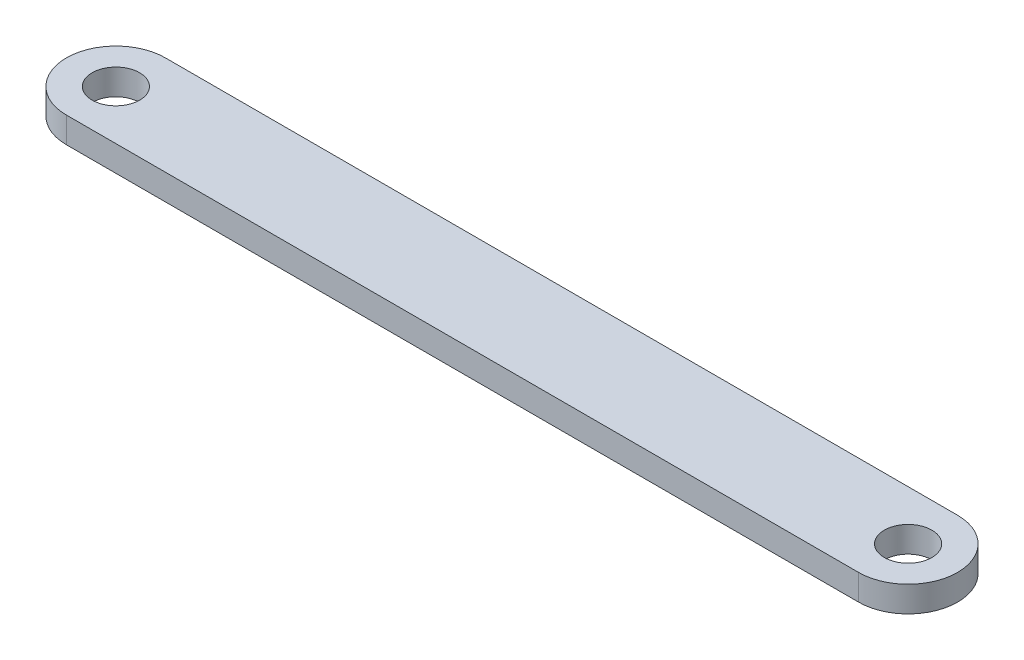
ISO-10303-21;
HEADER;
FILE_DESCRIPTION(('STEP AP214'),'2;1');
FILE_NAME('part.step','',(''),(''),'','','');
FILE_SCHEMA(('AUTOMOTIVE_DESIGN { 1 0 10303 214 1 1 1 1 }'));
ENDSEC;
DATA;
#1=APPLICATION_CONTEXT('core data for automotive mechanical design processes');
#2=APPLICATION_PROTOCOL_DEFINITION('international standard','automotive_design',2000,#1);
#3=PRODUCT_CONTEXT('',#1,'mechanical');
#4=PRODUCT('Part','Part','',(#3));
#5=PRODUCT_RELATED_PRODUCT_CATEGORY('part','',(#4));
#6=PRODUCT_DEFINITION_FORMATION('','',#4);
#7=PRODUCT_DEFINITION_CONTEXT('part definition',#1,'design');
#8=PRODUCT_DEFINITION('design','',#6,#7);
#9=PRODUCT_DEFINITION_SHAPE('','',#8);
#10=(LENGTH_UNIT() NAMED_UNIT(*) SI_UNIT(.MILLI.,.METRE.));
#11=(NAMED_UNIT(*) PLANE_ANGLE_UNIT() SI_UNIT($,.RADIAN.));
#12=(NAMED_UNIT(*) SI_UNIT($,.STERADIAN.) SOLID_ANGLE_UNIT());
#13=UNCERTAINTY_MEASURE_WITH_UNIT(LENGTH_MEASURE(1.E-05),#10,'distance_accuracy_value','');
#14=(GEOMETRIC_REPRESENTATION_CONTEXT(3) GLOBAL_UNCERTAINTY_ASSIGNED_CONTEXT((#13)) GLOBAL_UNIT_ASSIGNED_CONTEXT((#10,
#11,#12)) REPRESENTATION_CONTEXT('',''));
#15=CARTESIAN_POINT('',(0.,0.,0.));
#16=DIRECTION('',(0.,0.,1.));
#17=DIRECTION('',(1.,0.,0.));
#18=AXIS2_PLACEMENT_3D('',#15,#16,#17);
#19=CARTESIAN_POINT('',(0.,6.5,0.));
#20=DIRECTION('',(0.,1.,0.));
#21=DIRECTION('',(0.,0.,1.));
#22=AXIS2_PLACEMENT_3D('',#19,#20,#21);
#23=PLANE('',#22);
#24=CARTESIAN_POINT('',(0.,6.5,0.));
#25=DIRECTION('',(0.,1.,0.));
#26=DIRECTION('',(0.,0.,1.));
#27=AXIS2_PLACEMENT_3D('',#24,#25,#26);
#28=CIRCLE('',#27,6.);
#29=CARTESIAN_POINT('',(0.,6.5,-6.));
#30=VERTEX_POINT('',#29);
#31=EDGE_CURVE('E116',#30,#30,#28,.T.);
#32=ORIENTED_EDGE('',*,*,#31,.F.);
#33=EDGE_LOOP('',(#32));
#34=FACE_BOUND('',#33,.T.);
#35=CARTESIAN_POINT('',(0.,6.5,0.));
#36=DIRECTION('',(0.,1.,0.));
#37=DIRECTION('',(0.,0.,1.));
#38=AXIS2_PLACEMENT_3D('',#35,#36,#37);
#39=CIRCLE('',#38,12.5);
#40=CARTESIAN_POINT('',(0.,6.5,-12.5));
#41=VERTEX_POINT('',#40);
#42=CARTESIAN_POINT('',(0.,6.5,12.5));
#43=VERTEX_POINT('',#42);
#44=EDGE_CURVE('E96',#41,#43,#39,.T.);
#45=ORIENTED_EDGE('',*,*,#44,.T.);
#46=DIRECTION('',(1.,0.,0.));
#47=VECTOR('',#46,1.);
#48=CARTESIAN_POINT('',(0.,6.5,12.5));
#49=LINE('',#48,#47);
#50=CARTESIAN_POINT('',(200.,6.5,12.5));
#51=VERTEX_POINT('',#50);
#52=EDGE_CURVE('E91',#43,#51,#49,.T.);
#53=ORIENTED_EDGE('',*,*,#52,.T.);
#54=CARTESIAN_POINT('',(200.,6.5,0.));
#55=DIRECTION('',(0.,1.,0.));
#56=DIRECTION('',(0.,0.,1.));
#57=AXIS2_PLACEMENT_3D('',#54,#55,#56);
#58=CIRCLE('',#57,12.5);
#59=CARTESIAN_POINT('',(200.,6.5,-12.5));
#60=VERTEX_POINT('',#59);
#61=EDGE_CURVE('E94',#51,#60,#58,.T.);
#62=ORIENTED_EDGE('',*,*,#61,.T.);
#63=DIRECTION('',(-1.,0.,0.));
#64=VECTOR('',#63,1.);
#65=CARTESIAN_POINT('',(0.,6.5,-12.5));
#66=LINE('',#65,#64);
#67=EDGE_CURVE('E61',#60,#41,#66,.T.);
#68=ORIENTED_EDGE('',*,*,#67,.T.);
#69=EDGE_LOOP('',(#45,#53,#62,#68));
#70=FACE_BOUND('',#69,.T.);
#71=CARTESIAN_POINT('',(200.,6.5,0.));
#72=DIRECTION('',(0.,1.,0.));
#73=DIRECTION('',(0.,0.,1.));
#74=AXIS2_PLACEMENT_3D('',#71,#72,#73);
#75=CIRCLE('',#74,6.00000000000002);
#76=CARTESIAN_POINT('',(200.,6.5,-6.00000000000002));
#77=VERTEX_POINT('',#76);
#78=EDGE_CURVE('E138',#77,#77,#75,.T.);
#79=ORIENTED_EDGE('',*,*,#78,.F.);
#80=EDGE_LOOP('',(#79));
#81=FACE_BOUND('',#80,.T.);
#82=ADVANCED_FACE('F43',(#34,#70,#81),#23,.T.);
#83=CARTESIAN_POINT('',(0.,0.,0.));
#84=DIRECTION('',(0.,1.,0.));
#85=DIRECTION('',(0.,0.,1.));
#86=AXIS2_PLACEMENT_3D('',#83,#84,#85);
#87=PLANE('',#86);
#88=CARTESIAN_POINT('',(0.,0.,0.));
#89=DIRECTION('',(0.,1.,0.));
#90=DIRECTION('',(0.,0.,1.));
#91=AXIS2_PLACEMENT_3D('',#88,#89,#90);
#92=CIRCLE('',#91,12.5);
#93=CARTESIAN_POINT('',(0.,0.,-12.5));
#94=VERTEX_POINT('',#93);
#95=CARTESIAN_POINT('',(0.,0.,12.5));
#96=VERTEX_POINT('',#95);
#97=EDGE_CURVE('E112',#94,#96,#92,.T.);
#98=ORIENTED_EDGE('',*,*,#97,.F.);
#99=DIRECTION('',(-1.,0.,0.));
#100=VECTOR('',#99,1.);
#101=CARTESIAN_POINT('',(0.,0.,-12.5));
#102=LINE('',#101,#100);
#103=CARTESIAN_POINT('',(200.,0.,-12.5));
#104=VERTEX_POINT('',#103);
#105=EDGE_CURVE('E84',#104,#94,#102,.T.);
#106=ORIENTED_EDGE('',*,*,#105,.F.);
#107=CARTESIAN_POINT('',(200.,0.,0.));
#108=DIRECTION('',(0.,1.,0.));
#109=DIRECTION('',(0.,0.,1.));
#110=AXIS2_PLACEMENT_3D('',#107,#108,#109);
#111=CIRCLE('',#110,12.5);
#112=CARTESIAN_POINT('',(200.,0.,12.5));
#113=VERTEX_POINT('',#112);
#114=EDGE_CURVE('E78',#113,#104,#111,.T.);
#115=ORIENTED_EDGE('',*,*,#114,.F.);
#116=DIRECTION('',(1.,0.,0.));
#117=VECTOR('',#116,1.);
#118=CARTESIAN_POINT('',(0.,0.,12.5));
#119=LINE('',#118,#117);
#120=EDGE_CURVE('E101',#96,#113,#119,.T.);
#121=ORIENTED_EDGE('',*,*,#120,.F.);
#122=EDGE_LOOP('',(#98,#106,#115,#121));
#123=FACE_BOUND('',#122,.T.);
#124=CARTESIAN_POINT('',(0.,0.,0.));
#125=DIRECTION('',(0.,1.,0.));
#126=DIRECTION('',(0.,0.,1.));
#127=AXIS2_PLACEMENT_3D('',#124,#125,#126);
#128=CIRCLE('',#127,6.);
#129=CARTESIAN_POINT('',(0.,0.,-6.));
#130=VERTEX_POINT('',#129);
#131=EDGE_CURVE('E134',#130,#130,#128,.T.);
#132=ORIENTED_EDGE('',*,*,#131,.T.);
#133=EDGE_LOOP('',(#132));
#134=FACE_BOUND('',#133,.T.);
#135=CARTESIAN_POINT('',(200.,0.,0.));
#136=DIRECTION('',(0.,1.,0.));
#137=DIRECTION('',(0.,0.,1.));
#138=AXIS2_PLACEMENT_3D('',#135,#136,#137);
#139=CIRCLE('',#138,6.00000000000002);
#140=CARTESIAN_POINT('',(200.,0.,-6.00000000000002));
#141=VERTEX_POINT('',#140);
#142=EDGE_CURVE('E142',#141,#141,#139,.T.);
#143=ORIENTED_EDGE('',*,*,#142,.T.);
#144=EDGE_LOOP('',(#143));
#145=FACE_BOUND('',#144,.T.);
#146=ADVANCED_FACE('F129',(#123,#134,#145),#87,.F.);
#147=CARTESIAN_POINT('',(0.,6.5,0.));
#148=DIRECTION('',(0.,-1.,0.));
#149=DIRECTION('',(0.,0.,-1.));
#150=AXIS2_PLACEMENT_3D('',#147,#148,#149);
#151=CYLINDRICAL_SURFACE('',#150,12.5);
#152=ORIENTED_EDGE('',*,*,#97,.T.);
#153=DIRECTION('',(0.,-1.,0.));
#154=VECTOR('',#153,1.);
#155=CARTESIAN_POINT('',(0.,6.5,12.5));
#156=LINE('',#155,#154);
#157=EDGE_CURVE('E11',#43,#96,#156,.T.);
#158=ORIENTED_EDGE('',*,*,#157,.F.);
#159=ORIENTED_EDGE('',*,*,#44,.F.);
#160=DIRECTION('',(0.,-1.,0.));
#161=VECTOR('',#160,1.);
#162=CARTESIAN_POINT('',(0.,6.5,-12.5));
#163=LINE('',#162,#161);
#164=EDGE_CURVE('E108',#41,#94,#163,.T.);
#165=ORIENTED_EDGE('',*,*,#164,.T.);
#166=EDGE_LOOP('',(#152,#158,#159,#165));
#167=FACE_BOUND('',#166,.T.);
#168=ADVANCED_FACE('F45',(#167),#151,.T.);
#169=CARTESIAN_POINT('',(0.,6.5,12.5));
#170=DIRECTION('',(0.,0.,-1.));
#171=DIRECTION('',(-1.,0.,0.));
#172=AXIS2_PLACEMENT_3D('',#169,#170,#171);
#173=PLANE('',#172);
#174=ORIENTED_EDGE('',*,*,#120,.T.);
#175=DIRECTION('',(0.,-1.,0.));
#176=VECTOR('',#175,1.);
#177=CARTESIAN_POINT('',(200.,6.5,12.5));
#178=LINE('',#177,#176);
#179=EDGE_CURVE('E53',#51,#113,#178,.T.);
#180=ORIENTED_EDGE('',*,*,#179,.F.);
#181=ORIENTED_EDGE('',*,*,#52,.F.);
#182=ORIENTED_EDGE('',*,*,#157,.T.);
#183=EDGE_LOOP('',(#174,#180,#181,#182));
#184=FACE_BOUND('',#183,.T.);
#185=ADVANCED_FACE('F100',(#184),#173,.F.);
#186=CARTESIAN_POINT('',(200.,6.5,0.));
#187=DIRECTION('',(0.,-1.,0.));
#188=DIRECTION('',(0.,0.,-1.));
#189=AXIS2_PLACEMENT_3D('',#186,#187,#188);
#190=CYLINDRICAL_SURFACE('',#189,12.5);
#191=ORIENTED_EDGE('',*,*,#114,.T.);
#192=DIRECTION('',(0.,-1.,0.));
#193=VECTOR('',#192,1.);
#194=CARTESIAN_POINT('',(200.,6.5,-12.5));
#195=LINE('',#194,#193);
#196=EDGE_CURVE('E103',#60,#104,#195,.T.);
#197=ORIENTED_EDGE('',*,*,#196,.F.);
#198=ORIENTED_EDGE('',*,*,#61,.F.);
#199=ORIENTED_EDGE('',*,*,#179,.T.);
#200=EDGE_LOOP('',(#191,#197,#198,#199));
#201=FACE_BOUND('',#200,.T.);
#202=ADVANCED_FACE('F104',(#201),#190,.T.);
#203=CARTESIAN_POINT('',(0.,6.5,-12.5));
#204=DIRECTION('',(0.,0.,1.));
#205=DIRECTION('',(1.,0.,0.));
#206=AXIS2_PLACEMENT_3D('',#203,#204,#205);
#207=PLANE('',#206);
#208=ORIENTED_EDGE('',*,*,#105,.T.);
#209=ORIENTED_EDGE('',*,*,#164,.F.);
#210=ORIENTED_EDGE('',*,*,#67,.F.);
#211=ORIENTED_EDGE('',*,*,#196,.T.);
#212=EDGE_LOOP('',(#208,#209,#210,#211));
#213=FACE_BOUND('',#212,.T.);
#214=ADVANCED_FACE('F126',(#213),#207,.F.);
#215=CARTESIAN_POINT('',(0.,6.5,0.));
#216=DIRECTION('',(0.,-1.,0.));
#217=DIRECTION('',(0.,0.,-1.));
#218=AXIS2_PLACEMENT_3D('',#215,#216,#217);
#219=CYLINDRICAL_SURFACE('',#218,6.);
#220=CARTESIAN_POINT('',(0.,6.5,-6.));
#221=CARTESIAN_POINT('',(0.,6.43229166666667,-6.));
#222=CARTESIAN_POINT('',(0.,6.36458333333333,-6.));
#223=CARTESIAN_POINT('',(0.,6.22916666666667,-6.));
#224=CARTESIAN_POINT('',(0.,6.16145833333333,-6.));
#225=CARTESIAN_POINT('',(0.,6.02604166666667,-6.));
#226=CARTESIAN_POINT('',(0.,5.95833333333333,-6.));
#227=CARTESIAN_POINT('',(0.,5.82291666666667,-6.));
#228=CARTESIAN_POINT('',(0.,5.75520833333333,-6.));
#229=CARTESIAN_POINT('',(0.,5.61979166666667,-6.));
#230=CARTESIAN_POINT('',(0.,5.55208333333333,-6.));
#231=CARTESIAN_POINT('',(0.,5.41666666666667,-6.));
#232=CARTESIAN_POINT('',(0.,5.34895833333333,-6.));
#233=CARTESIAN_POINT('',(0.,5.21354166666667,-6.));
#234=CARTESIAN_POINT('',(0.,5.14583333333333,-6.));
#235=CARTESIAN_POINT('',(0.,5.01041666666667,-6.));
#236=CARTESIAN_POINT('',(0.,4.94270833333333,-6.));
#237=CARTESIAN_POINT('',(0.,4.80729166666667,-6.));
#238=CARTESIAN_POINT('',(0.,4.73958333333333,-6.));
#239=CARTESIAN_POINT('',(0.,4.60416666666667,-6.));
#240=CARTESIAN_POINT('',(0.,4.53645833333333,-6.));
#241=CARTESIAN_POINT('',(0.,4.40104166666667,-6.));
#242=CARTESIAN_POINT('',(0.,4.33333333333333,-6.));
#243=CARTESIAN_POINT('',(0.,4.19791666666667,-6.));
#244=CARTESIAN_POINT('',(0.,4.13020833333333,-6.));
#245=CARTESIAN_POINT('',(0.,3.99479166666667,-6.));
#246=CARTESIAN_POINT('',(0.,3.92708333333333,-6.));
#247=CARTESIAN_POINT('',(0.,3.79166666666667,-6.));
#248=CARTESIAN_POINT('',(0.,3.72395833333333,-6.));
#249=CARTESIAN_POINT('',(0.,3.58854166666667,-6.));
#250=CARTESIAN_POINT('',(0.,3.52083333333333,-6.));
#251=CARTESIAN_POINT('',(0.,3.38541666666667,-6.));
#252=CARTESIAN_POINT('',(0.,3.31770833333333,-6.));
#253=CARTESIAN_POINT('',(0.,3.18229166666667,-6.));
#254=CARTESIAN_POINT('',(0.,3.11458333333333,-6.));
#255=CARTESIAN_POINT('',(0.,2.97916666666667,-6.));
#256=CARTESIAN_POINT('',(0.,2.91145833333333,-6.));
#257=CARTESIAN_POINT('',(0.,2.77604166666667,-6.));
#258=CARTESIAN_POINT('',(0.,2.70833333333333,-6.));
#259=CARTESIAN_POINT('',(0.,2.57291666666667,-6.));
#260=CARTESIAN_POINT('',(0.,2.50520833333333,-6.));
#261=CARTESIAN_POINT('',(0.,2.36979166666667,-6.));
#262=CARTESIAN_POINT('',(0.,2.30208333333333,-6.));
#263=CARTESIAN_POINT('',(0.,2.16666666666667,-6.));
#264=CARTESIAN_POINT('',(0.,2.09895833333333,-6.));
#265=CARTESIAN_POINT('',(0.,1.96354166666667,-6.));
#266=CARTESIAN_POINT('',(0.,1.89583333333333,-6.));
#267=CARTESIAN_POINT('',(0.,1.76041666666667,-6.));
#268=CARTESIAN_POINT('',(0.,1.69270833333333,-6.));
#269=CARTESIAN_POINT('',(0.,1.55729166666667,-6.));
#270=CARTESIAN_POINT('',(0.,1.48958333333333,-6.));
#271=CARTESIAN_POINT('',(0.,1.35416666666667,-6.));
#272=CARTESIAN_POINT('',(0.,1.28645833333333,-6.));
#273=CARTESIAN_POINT('',(0.,1.15104166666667,-6.));
#274=CARTESIAN_POINT('',(0.,1.08333333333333,-6.));
#275=CARTESIAN_POINT('',(0.,0.947916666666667,-6.));
#276=CARTESIAN_POINT('',(0.,0.880208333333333,-6.));
#277=CARTESIAN_POINT('',(0.,0.744791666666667,-6.));
#278=CARTESIAN_POINT('',(0.,0.677083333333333,-6.));
#279=CARTESIAN_POINT('',(0.,0.541666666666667,-6.));
#280=CARTESIAN_POINT('',(0.,0.473958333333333,-6.));
#281=CARTESIAN_POINT('',(0.,0.338541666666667,-6.));
#282=CARTESIAN_POINT('',(0.,0.270833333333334,-6.));
#283=CARTESIAN_POINT('',(0.,0.135416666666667,-6.));
#284=CARTESIAN_POINT('',(0.,0.0677083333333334,-6.));
#285=CARTESIAN_POINT('',(0.,0.,-6.));
#286=B_SPLINE_CURVE_WITH_KNOTS('',3,(#220,#221,#222,#223,#224,#225,#226,#227,#228,#229,#230,
#231,#232,#233,#234,#235,#236,#237,#238,#239,#240,#241,#242,#243,#244,#245,#246,#247,#248,#249,
#250,#251,#252,#253,#254,#255,#256,#257,#258,#259,#260,#261,#262,#263,#264,#265,#266,#267,#268,
#269,#270,#271,#272,#273,#274,#275,#276,#277,#278,#279,#280,#281,#282,#283,#284,#285),
.UNSPECIFIED.,.F.,.F.,(4,2,2,2,2,2,2,2,2,2,2,2,2,2,2,2,2,2,2,2,2,2,2,2,2,2,2,2,2,2,2,2,4),(0.,
0.203125,0.40625,0.609375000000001,0.812500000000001,1.015625,1.21875,1.421875,1.625,1.828125,
2.03125,2.234375,2.4375,2.640625,2.84375,3.046875,3.25,3.453125,3.65625,3.859375,4.0625,
4.265625,4.46875,4.671875,4.875,5.078125,5.28125,5.484375,5.6875,5.890625,6.09375,6.296875,6.5),.UNSPECIFIED.);
#287=EDGE_CURVE('BSEAM161',#30,#130,#286,.T.);
#288=ORIENTED_EDGE('',*,*,#31,.T.);
#289=ORIENTED_EDGE('',*,*,#131,.F.);
#290=ORIENTED_EDGE('',*,*,#287,.T.);
#291=ORIENTED_EDGE('',*,*,#287,.F.);
#292=EDGE_LOOP('',(#288,#290,#289,#291));
#293=FACE_BOUND('',#292,.T.);
#294=ADVANCED_FACE('F161',(#293),#219,.F.);
#295=CARTESIAN_POINT('',(200.,6.5,0.));
#296=DIRECTION('',(0.,-1.,0.));
#297=DIRECTION('',(0.,0.,-1.));
#298=AXIS2_PLACEMENT_3D('',#295,#296,#297);
#299=CYLINDRICAL_SURFACE('',#298,6.00000000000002);
#300=CARTESIAN_POINT('',(200.,6.5,-6.00000000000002));
#301=CARTESIAN_POINT('',(200.,6.43229166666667,-6.00000000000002));
#302=CARTESIAN_POINT('',(200.,6.36458333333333,-6.00000000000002));
#303=CARTESIAN_POINT('',(200.,6.22916666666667,-6.00000000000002));
#304=CARTESIAN_POINT('',(200.,6.16145833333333,-6.00000000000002));
#305=CARTESIAN_POINT('',(200.,6.02604166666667,-6.00000000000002));
#306=CARTESIAN_POINT('',(200.,5.95833333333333,-6.00000000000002));
#307=CARTESIAN_POINT('',(200.,5.82291666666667,-6.00000000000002));
#308=CARTESIAN_POINT('',(200.,5.75520833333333,-6.00000000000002));
#309=CARTESIAN_POINT('',(200.,5.61979166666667,-6.00000000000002));
#310=CARTESIAN_POINT('',(200.,5.55208333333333,-6.00000000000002));
#311=CARTESIAN_POINT('',(200.,5.41666666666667,-6.00000000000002));
#312=CARTESIAN_POINT('',(200.,5.34895833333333,-6.00000000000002));
#313=CARTESIAN_POINT('',(200.,5.21354166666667,-6.00000000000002));
#314=CARTESIAN_POINT('',(200.,5.14583333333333,-6.00000000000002));
#315=CARTESIAN_POINT('',(200.,5.01041666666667,-6.00000000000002));
#316=CARTESIAN_POINT('',(200.,4.94270833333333,-6.00000000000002));
#317=CARTESIAN_POINT('',(200.,4.80729166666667,-6.00000000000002));
#318=CARTESIAN_POINT('',(200.,4.73958333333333,-6.00000000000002));
#319=CARTESIAN_POINT('',(200.,4.60416666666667,-6.00000000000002));
#320=CARTESIAN_POINT('',(200.,4.53645833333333,-6.00000000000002));
#321=CARTESIAN_POINT('',(200.,4.40104166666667,-6.00000000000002));
#322=CARTESIAN_POINT('',(200.,4.33333333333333,-6.00000000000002));
#323=CARTESIAN_POINT('',(200.,4.19791666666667,-6.00000000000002));
#324=CARTESIAN_POINT('',(200.,4.13020833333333,-6.00000000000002));
#325=CARTESIAN_POINT('',(200.,3.99479166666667,-6.00000000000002));
#326=CARTESIAN_POINT('',(200.,3.92708333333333,-6.00000000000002));
#327=CARTESIAN_POINT('',(200.,3.79166666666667,-6.00000000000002));
#328=CARTESIAN_POINT('',(200.,3.72395833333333,-6.00000000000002));
#329=CARTESIAN_POINT('',(200.,3.58854166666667,-6.00000000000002));
#330=CARTESIAN_POINT('',(200.,3.52083333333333,-6.00000000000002));
#331=CARTESIAN_POINT('',(200.,3.38541666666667,-6.00000000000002));
#332=CARTESIAN_POINT('',(200.,3.31770833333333,-6.00000000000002));
#333=CARTESIAN_POINT('',(200.,3.18229166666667,-6.00000000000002));
#334=CARTESIAN_POINT('',(200.,3.11458333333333,-6.00000000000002));
#335=CARTESIAN_POINT('',(200.,2.97916666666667,-6.00000000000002));
#336=CARTESIAN_POINT('',(200.,2.91145833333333,-6.00000000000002));
#337=CARTESIAN_POINT('',(200.,2.77604166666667,-6.00000000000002));
#338=CARTESIAN_POINT('',(200.,2.70833333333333,-6.00000000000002));
#339=CARTESIAN_POINT('',(200.,2.57291666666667,-6.00000000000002));
#340=CARTESIAN_POINT('',(200.,2.50520833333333,-6.00000000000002));
#341=CARTESIAN_POINT('',(200.,2.36979166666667,-6.00000000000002));
#342=CARTESIAN_POINT('',(200.,2.30208333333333,-6.00000000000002));
#343=CARTESIAN_POINT('',(200.,2.16666666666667,-6.00000000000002));
#344=CARTESIAN_POINT('',(200.,2.09895833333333,-6.00000000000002));
#345=CARTESIAN_POINT('',(200.,1.96354166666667,-6.00000000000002));
#346=CARTESIAN_POINT('',(200.,1.89583333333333,-6.00000000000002));
#347=CARTESIAN_POINT('',(200.,1.76041666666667,-6.00000000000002));
#348=CARTESIAN_POINT('',(200.,1.69270833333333,-6.00000000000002));
#349=CARTESIAN_POINT('',(200.,1.55729166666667,-6.00000000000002));
#350=CARTESIAN_POINT('',(200.,1.48958333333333,-6.00000000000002));
#351=CARTESIAN_POINT('',(200.,1.35416666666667,-6.00000000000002));
#352=CARTESIAN_POINT('',(200.,1.28645833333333,-6.00000000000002));
#353=CARTESIAN_POINT('',(200.,1.15104166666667,-6.00000000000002));
#354=CARTESIAN_POINT('',(200.,1.08333333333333,-6.00000000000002));
#355=CARTESIAN_POINT('',(200.,0.947916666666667,-6.00000000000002));
#356=CARTESIAN_POINT('',(200.,0.880208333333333,-6.00000000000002));
#357=CARTESIAN_POINT('',(200.,0.744791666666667,-6.00000000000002));
#358=CARTESIAN_POINT('',(200.,0.677083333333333,-6.00000000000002));
#359=CARTESIAN_POINT('',(200.,0.541666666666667,-6.00000000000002));
#360=CARTESIAN_POINT('',(200.,0.473958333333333,-6.00000000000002));
#361=CARTESIAN_POINT('',(200.,0.338541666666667,-6.00000000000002));
#362=CARTESIAN_POINT('',(200.,0.270833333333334,-6.00000000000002));
#363=CARTESIAN_POINT('',(200.,0.135416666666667,-6.00000000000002));
#364=CARTESIAN_POINT('',(200.,0.0677083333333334,-6.00000000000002));
#365=CARTESIAN_POINT('',(200.,0.,-6.00000000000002));
#366=B_SPLINE_CURVE_WITH_KNOTS('',3,(#300,#301,#302,#303,#304,#305,#306,#307,#308,#309,#310,
#311,#312,#313,#314,#315,#316,#317,#318,#319,#320,#321,#322,#323,#324,#325,#326,#327,#328,#329,
#330,#331,#332,#333,#334,#335,#336,#337,#338,#339,#340,#341,#342,#343,#344,#345,#346,#347,#348,
#349,#350,#351,#352,#353,#354,#355,#356,#357,#358,#359,#360,#361,#362,#363,#364,#365),
.UNSPECIFIED.,.F.,.F.,(4,2,2,2,2,2,2,2,2,2,2,2,2,2,2,2,2,2,2,2,2,2,2,2,2,2,2,2,2,2,2,2,4),(0.,
0.203125,0.40625,0.609375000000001,0.812500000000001,1.015625,1.21875,1.421875,1.625,1.828125,
2.03125,2.234375,2.4375,2.640625,2.84375,3.046875,3.25,3.453125,3.65625,3.859375,4.0625,
4.265625,4.46875,4.671875,4.875,5.078125,5.28125,5.484375,5.6875,5.890625,6.09375,6.296875,6.5),.UNSPECIFIED.);
#367=EDGE_CURVE('BSEAM150',#77,#141,#366,.T.);
#368=ORIENTED_EDGE('',*,*,#78,.T.);
#369=ORIENTED_EDGE('',*,*,#142,.F.);
#370=ORIENTED_EDGE('',*,*,#367,.T.);
#371=ORIENTED_EDGE('',*,*,#367,.F.);
#372=EDGE_LOOP('',(#368,#370,#369,#371));
#373=FACE_BOUND('',#372,.T.);
#374=ADVANCED_FACE('F150',(#373),#299,.F.);
#375=CLOSED_SHELL('',(#82,#146,#168,#185,#202,#214,#294,#374));
#376=MANIFOLD_SOLID_BREP('B2',#375);
#377=ADVANCED_BREP_SHAPE_REPRESENTATION('',(#18,#376),#14);
#378=SHAPE_DEFINITION_REPRESENTATION(#9,#377);
ENDSEC;
END-ISO-10303-21;
